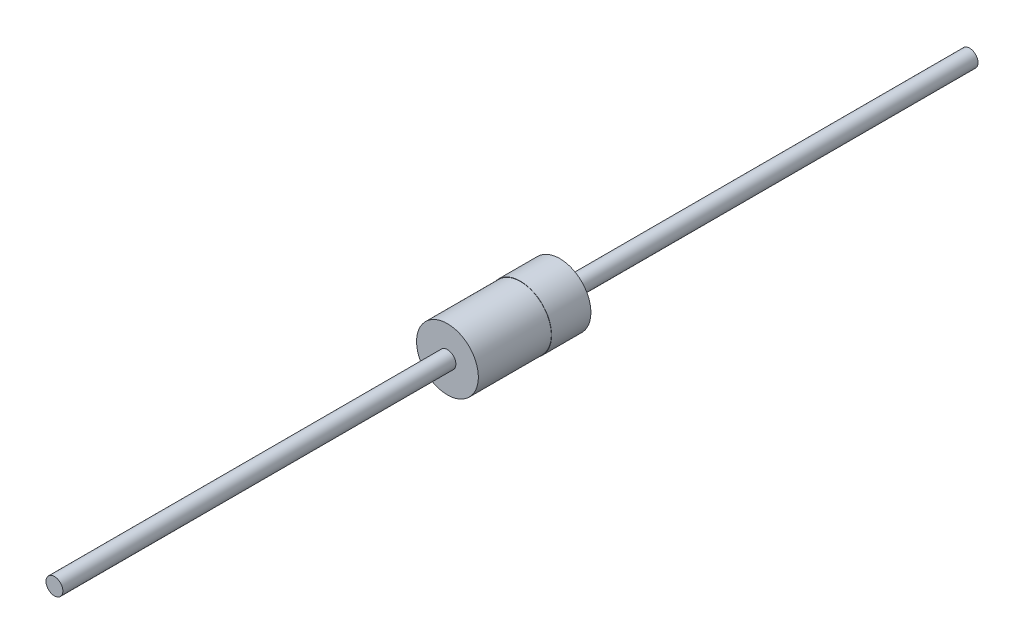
from build123d import *

# Parameters (mm, degrees)
SKETCH1_R                = 1.397
BASE_EXTRUDE_DEPTH       = 3.302
BOSS_EXTRUDE1_DEPTH      = 17.78
BOSS_EXTRUDE1_DEPTH_BACK = 5.08
SKETCH2_R                = 0.381
SKETCH3_R                = 0.381
BOSS_EXTRUDE2_DEPTH      = 20.32
SKETCH4_R                = 1.4097
BOSS_EXTRUDE3_DEPTH      = 1.778


with BuildPart() as part:
    # Sketch1 → Base-Extrude (new body)
    with BuildSketch(Plane.XY):
        with Locations(Location((0, 0, 0), (0, 0, 180))):
            Circle(SKETCH1_R)
    extrude(amount=BASE_EXTRUDE_DEPTH)

    # Sketch2 → Boss-Extrude1 (add, two sides: drawn at the far end of the back side and taken through both)
    with BuildSketch(Plane.XY.offset(3.302).offset(-BOSS_EXTRUDE1_DEPTH_BACK)):
        with Locations(Location((0, 0, 0), (0, 0, 180))):
            Circle(SKETCH2_R)
    extrude(amount=BOSS_EXTRUDE1_DEPTH + BOSS_EXTRUDE1_DEPTH_BACK)

    # Sketch3 → Boss-Extrude2 (add)
    with BuildSketch(Plane(origin=(0, 0, 0), x_dir=(-1, 0, 0), z_dir=(0, 0, -1))):
        Circle(SKETCH3_R)
    extrude(amount=BOSS_EXTRUDE2_DEPTH)

    # Sketch4 → Boss-Extrude3 (add)
    with BuildSketch(Plane(origin=(0, 0, 0), x_dir=(-1, 0, 0), z_dir=(0, 0, -1))):
        with Locations(Location((0, 0, 0), (0, 0, 180))):
            Circle(SKETCH4_R)
    extrude(amount=BOSS_EXTRUDE3_DEPTH)


solid = part.part
